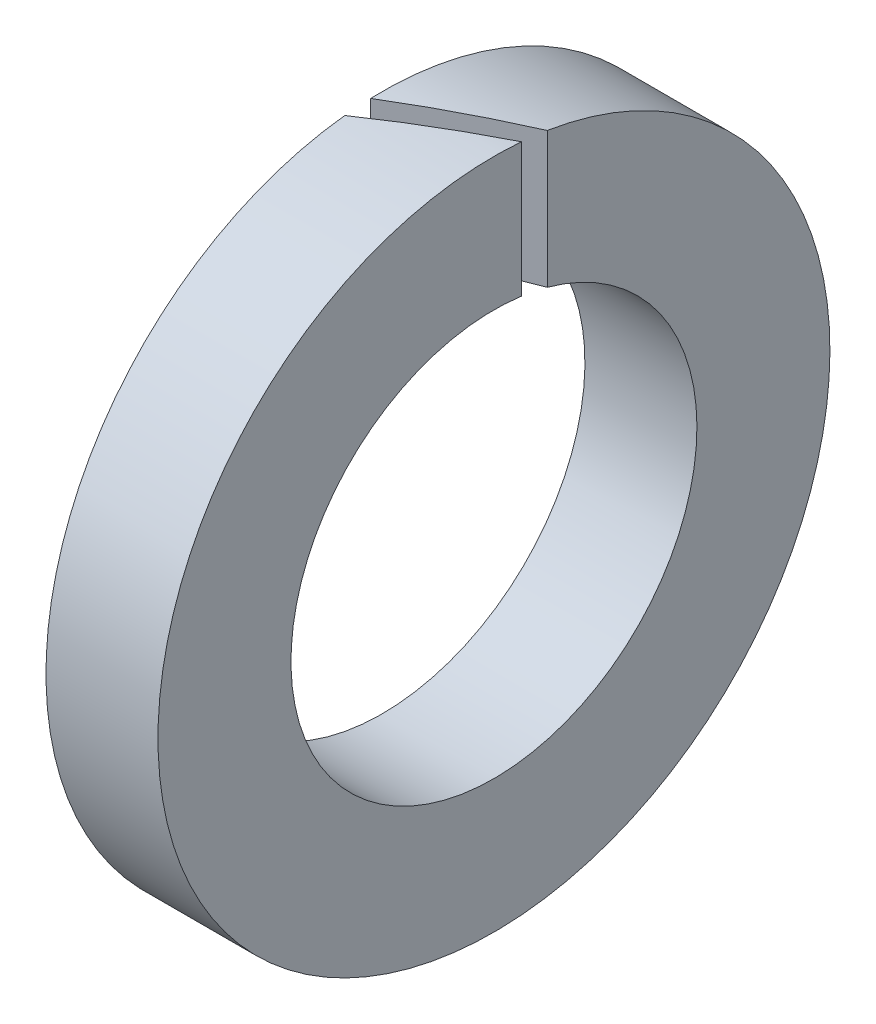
from build123d import *

# Parameters (mm, degrees)
ESQUISSE1_R             = 12
ESQUISSE1_R_2           = 7.25
BASE_EXTRUSION_DEPTH    = 4
ENL_V_MAT_EXTRU_1_DEPTH = 18.435595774


with BuildPart() as part:
    # Esquisse1 → Base-Extrusion (new body)
    with BuildSketch(Plane(origin=(0, 0, 0), x_dir=(0, 0, -1), z_dir=(1, 0, 0))):
        Circle(ESQUISSE1_R)
        Circle(ESQUISSE1_R_2, mode=Mode.SUBTRACT)
    extrude(amount=BASE_EXTRUSION_DEPTH)

    # Esquisse2 → Enl_v. mat.-Extru.1 (cut, through all)
    with BuildSketch(Plane(origin=(0, 0, 0), x_dir=(1, 0, 0), z_dir=(0, 1, 0))):
        Polygon((-0.442762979, -0.659774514), (-0.08898076, -1.379281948), (4.426404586, 1.227676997), (4.026403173, 1.920499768), align=None)
    extrude(amount=ENL_V_MAT_EXTRU_1_DEPTH, mode=Mode.SUBTRACT)


solid = part.part
